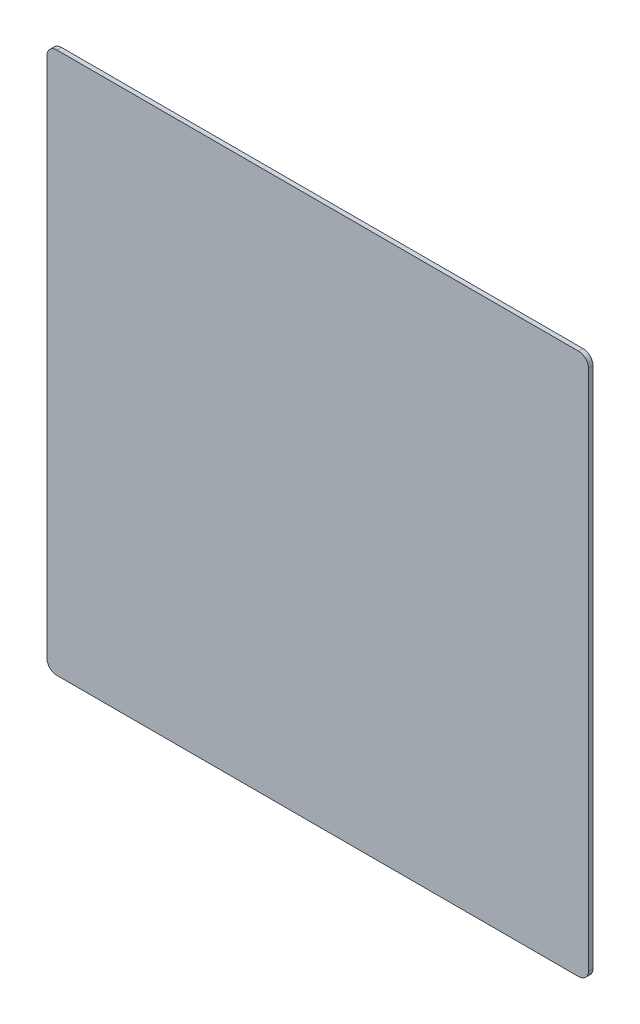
ISO-10303-21;
HEADER;
FILE_DESCRIPTION(('STEP AP214'),'2;1');
FILE_NAME('part.step','',(''),(''),'','','');
FILE_SCHEMA(('AUTOMOTIVE_DESIGN { 1 0 10303 214 1 1 1 1 }'));
ENDSEC;
DATA;
#1=APPLICATION_CONTEXT('core data for automotive mechanical design processes');
#2=APPLICATION_PROTOCOL_DEFINITION('international standard','automotive_design',2000,#1);
#3=PRODUCT_CONTEXT('',#1,'mechanical');
#4=PRODUCT('Part','Part','',(#3));
#5=PRODUCT_RELATED_PRODUCT_CATEGORY('part','',(#4));
#6=PRODUCT_DEFINITION_FORMATION('','',#4);
#7=PRODUCT_DEFINITION_CONTEXT('part definition',#1,'design');
#8=PRODUCT_DEFINITION('design','',#6,#7);
#9=PRODUCT_DEFINITION_SHAPE('','',#8);
#10=(LENGTH_UNIT() NAMED_UNIT(*) SI_UNIT(.MILLI.,.METRE.));
#11=(NAMED_UNIT(*) PLANE_ANGLE_UNIT() SI_UNIT($,.RADIAN.));
#12=(NAMED_UNIT(*) SI_UNIT($,.STERADIAN.) SOLID_ANGLE_UNIT());
#13=UNCERTAINTY_MEASURE_WITH_UNIT(LENGTH_MEASURE(1.E-05),#10,'distance_accuracy_value','');
#14=(GEOMETRIC_REPRESENTATION_CONTEXT(3) GLOBAL_UNCERTAINTY_ASSIGNED_CONTEXT((#13)) GLOBAL_UNIT_ASSIGNED_CONTEXT((#10,
#11,#12)) REPRESENTATION_CONTEXT('',''));
#15=CARTESIAN_POINT('',(0.,0.,0.));
#16=DIRECTION('',(0.,0.,1.));
#17=DIRECTION('',(1.,0.,0.));
#18=AXIS2_PLACEMENT_3D('',#15,#16,#17);
#19=CARTESIAN_POINT('',(289.,289.,5.));
#20=DIRECTION('',(0.,0.,-1.));
#21=DIRECTION('',(-1.,0.,0.));
#22=AXIS2_PLACEMENT_3D('',#19,#20,#21);
#23=CYLINDRICAL_SURFACE('',#22,11.);
#24=CARTESIAN_POINT('',(289.,289.,0.));
#25=DIRECTION('',(0.,0.,1.));
#26=DIRECTION('',(-1.,0.,0.));
#27=AXIS2_PLACEMENT_3D('',#24,#25,#26);
#28=CIRCLE('',#27,11.);
#29=CARTESIAN_POINT('',(300.,289.,0.));
#30=VERTEX_POINT('',#29);
#31=CARTESIAN_POINT('',(289.,300.,0.));
#32=VERTEX_POINT('',#31);
#33=EDGE_CURVE('E131',#30,#32,#28,.T.);
#34=ORIENTED_EDGE('',*,*,#33,.T.);
#35=DIRECTION('',(0.,0.,-1.));
#36=VECTOR('',#35,1.);
#37=CARTESIAN_POINT('',(289.,300.,5.));
#38=LINE('',#37,#36);
#39=CARTESIAN_POINT('',(289.,300.,5.));
#40=VERTEX_POINT('',#39);
#41=EDGE_CURVE('E11',#40,#32,#38,.T.);
#42=ORIENTED_EDGE('',*,*,#41,.F.);
#43=CARTESIAN_POINT('',(289.,289.,5.));
#44=DIRECTION('',(0.,0.,1.));
#45=DIRECTION('',(-1.,0.,0.));
#46=AXIS2_PLACEMENT_3D('',#43,#44,#45);
#47=CIRCLE('',#46,11.);
#48=CARTESIAN_POINT('',(300.,289.,5.));
#49=VERTEX_POINT('',#48);
#50=EDGE_CURVE('E145',#49,#40,#47,.T.);
#51=ORIENTED_EDGE('',*,*,#50,.F.);
#52=DIRECTION('',(0.,0.,-1.));
#53=VECTOR('',#52,1.);
#54=CARTESIAN_POINT('',(300.,289.,5.));
#55=LINE('',#54,#53);
#56=EDGE_CURVE('E127',#49,#30,#55,.T.);
#57=ORIENTED_EDGE('',*,*,#56,.T.);
#58=EDGE_LOOP('',(#34,#42,#51,#57));
#59=FACE_BOUND('',#58,.T.);
#60=ADVANCED_FACE('F35',(#59),#23,.T.);
#61=CARTESIAN_POINT('',(-289.,300.,5.));
#62=DIRECTION('',(0.,-1.,0.));
#63=DIRECTION('',(0.,0.,-1.));
#64=AXIS2_PLACEMENT_3D('',#61,#62,#63);
#65=PLANE('',#64);
#66=DIRECTION('',(-1.,0.,0.));
#67=VECTOR('',#66,1.);
#68=CARTESIAN_POINT('',(-289.,300.,0.));
#69=LINE('',#68,#67);
#70=CARTESIAN_POINT('',(-289.,300.,0.));
#71=VERTEX_POINT('',#70);
#72=EDGE_CURVE('E134',#32,#71,#69,.T.);
#73=ORIENTED_EDGE('',*,*,#72,.T.);
#74=DIRECTION('',(0.,0.,-1.));
#75=VECTOR('',#74,1.);
#76=CARTESIAN_POINT('',(-289.,300.,5.));
#77=LINE('',#76,#75);
#78=CARTESIAN_POINT('',(-289.,300.,5.));
#79=VERTEX_POINT('',#78);
#80=EDGE_CURVE('E43',#79,#71,#77,.T.);
#81=ORIENTED_EDGE('',*,*,#80,.F.);
#82=DIRECTION('',(-1.,0.,0.));
#83=VECTOR('',#82,1.);
#84=CARTESIAN_POINT('',(-289.,300.,5.));
#85=LINE('',#84,#83);
#86=EDGE_CURVE('E94',#40,#79,#85,.T.);
#87=ORIENTED_EDGE('',*,*,#86,.F.);
#88=ORIENTED_EDGE('',*,*,#41,.T.);
#89=EDGE_LOOP('',(#73,#81,#87,#88));
#90=FACE_BOUND('',#89,.T.);
#91=ADVANCED_FACE('F180',(#90),#65,.F.);
#92=CARTESIAN_POINT('',(-289.,289.,5.));
#93=DIRECTION('',(0.,0.,-1.));
#94=DIRECTION('',(-1.,0.,0.));
#95=AXIS2_PLACEMENT_3D('',#92,#93,#94);
#96=CYLINDRICAL_SURFACE('',#95,11.);
#97=CARTESIAN_POINT('',(-289.,289.,0.));
#98=DIRECTION('',(0.,0.,1.));
#99=DIRECTION('',(-1.,0.,0.));
#100=AXIS2_PLACEMENT_3D('',#97,#98,#99);
#101=CIRCLE('',#100,11.);
#102=CARTESIAN_POINT('',(-300.,289.,0.));
#103=VERTEX_POINT('',#102);
#104=EDGE_CURVE('E136',#71,#103,#101,.T.);
#105=ORIENTED_EDGE('',*,*,#104,.T.);
#106=DIRECTION('',(0.,0.,-1.));
#107=VECTOR('',#106,1.);
#108=CARTESIAN_POINT('',(-300.,289.,5.));
#109=LINE('',#108,#107);
#110=CARTESIAN_POINT('',(-300.,289.,5.));
#111=VERTEX_POINT('',#110);
#112=EDGE_CURVE('E152',#111,#103,#109,.T.);
#113=ORIENTED_EDGE('',*,*,#112,.F.);
#114=CARTESIAN_POINT('',(-289.,289.,5.));
#115=DIRECTION('',(0.,0.,1.));
#116=DIRECTION('',(-1.,0.,0.));
#117=AXIS2_PLACEMENT_3D('',#114,#115,#116);
#118=CIRCLE('',#117,11.);
#119=EDGE_CURVE('E160',#79,#111,#118,.T.);
#120=ORIENTED_EDGE('',*,*,#119,.F.);
#121=ORIENTED_EDGE('',*,*,#80,.T.);
#122=EDGE_LOOP('',(#105,#113,#120,#121));
#123=FACE_BOUND('',#122,.T.);
#124=ADVANCED_FACE('F158',(#123),#96,.T.);
#125=CARTESIAN_POINT('',(-300.,-289.,5.));
#126=DIRECTION('',(1.,0.,0.));
#127=DIRECTION('',(0.,0.,-1.));
#128=AXIS2_PLACEMENT_3D('',#125,#126,#127);
#129=PLANE('',#128);
#130=DIRECTION('',(0.,-1.,0.));
#131=VECTOR('',#130,1.);
#132=CARTESIAN_POINT('',(-300.,-289.,0.));
#133=LINE('',#132,#131);
#134=CARTESIAN_POINT('',(-300.,-289.,0.));
#135=VERTEX_POINT('',#134);
#136=EDGE_CURVE('E138',#103,#135,#133,.T.);
#137=ORIENTED_EDGE('',*,*,#136,.T.);
#138=DIRECTION('',(0.,0.,-1.));
#139=VECTOR('',#138,1.);
#140=CARTESIAN_POINT('',(-300.,-289.,5.));
#141=LINE('',#140,#139);
#142=CARTESIAN_POINT('',(-300.,-289.,5.));
#143=VERTEX_POINT('',#142);
#144=EDGE_CURVE('E149',#143,#135,#141,.T.);
#145=ORIENTED_EDGE('',*,*,#144,.F.);
#146=DIRECTION('',(0.,-1.,0.));
#147=VECTOR('',#146,1.);
#148=CARTESIAN_POINT('',(-300.,-289.,5.));
#149=LINE('',#148,#147);
#150=EDGE_CURVE('E172',#111,#143,#149,.T.);
#151=ORIENTED_EDGE('',*,*,#150,.F.);
#152=ORIENTED_EDGE('',*,*,#112,.T.);
#153=EDGE_LOOP('',(#137,#145,#151,#152));
#154=FACE_BOUND('',#153,.T.);
#155=ADVANCED_FACE('F168',(#154),#129,.F.);
#156=CARTESIAN_POINT('',(-289.,-289.,5.));
#157=DIRECTION('',(0.,0.,-1.));
#158=DIRECTION('',(-1.,0.,0.));
#159=AXIS2_PLACEMENT_3D('',#156,#157,#158);
#160=CYLINDRICAL_SURFACE('',#159,11.);
#161=CARTESIAN_POINT('',(-289.,-289.,0.));
#162=DIRECTION('',(0.,0.,1.));
#163=DIRECTION('',(-1.,0.,0.));
#164=AXIS2_PLACEMENT_3D('',#161,#162,#163);
#165=CIRCLE('',#164,11.);
#166=CARTESIAN_POINT('',(-289.,-300.,0.));
#167=VERTEX_POINT('',#166);
#168=EDGE_CURVE('E140',#135,#167,#165,.T.);
#169=ORIENTED_EDGE('',*,*,#168,.T.);
#170=DIRECTION('',(0.,0.,-1.));
#171=VECTOR('',#170,1.);
#172=CARTESIAN_POINT('',(-289.,-300.,5.));
#173=LINE('',#172,#171);
#174=CARTESIAN_POINT('',(-289.,-300.,5.));
#175=VERTEX_POINT('',#174);
#176=EDGE_CURVE('E122',#175,#167,#173,.T.);
#177=ORIENTED_EDGE('',*,*,#176,.F.);
#178=CARTESIAN_POINT('',(-289.,-289.,5.));
#179=DIRECTION('',(0.,0.,1.));
#180=DIRECTION('',(-1.,0.,0.));
#181=AXIS2_PLACEMENT_3D('',#178,#179,#180);
#182=CIRCLE('',#181,11.);
#183=EDGE_CURVE('E113',#143,#175,#182,.T.);
#184=ORIENTED_EDGE('',*,*,#183,.F.);
#185=ORIENTED_EDGE('',*,*,#144,.T.);
#186=EDGE_LOOP('',(#169,#177,#184,#185));
#187=FACE_BOUND('',#186,.T.);
#188=ADVANCED_FACE('F171',(#187),#160,.T.);
#189=CARTESIAN_POINT('',(-289.,-300.,5.));
#190=DIRECTION('',(0.,1.,0.));
#191=DIRECTION('',(0.,0.,1.));
#192=AXIS2_PLACEMENT_3D('',#189,#190,#191);
#193=PLANE('',#192);
#194=DIRECTION('',(1.,0.,0.));
#195=VECTOR('',#194,1.);
#196=CARTESIAN_POINT('',(-289.,-300.,0.));
#197=LINE('',#196,#195);
#198=CARTESIAN_POINT('',(289.,-300.,0.));
#199=VERTEX_POINT('',#198);
#200=EDGE_CURVE('E121',#167,#199,#197,.T.);
#201=ORIENTED_EDGE('',*,*,#200,.T.);
#202=DIRECTION('',(0.,0.,-1.));
#203=VECTOR('',#202,1.);
#204=CARTESIAN_POINT('',(289.,-300.,5.));
#205=LINE('',#204,#203);
#206=CARTESIAN_POINT('',(289.,-300.,5.));
#207=VERTEX_POINT('',#206);
#208=EDGE_CURVE('E118',#207,#199,#205,.T.);
#209=ORIENTED_EDGE('',*,*,#208,.F.);
#210=DIRECTION('',(1.,0.,0.));
#211=VECTOR('',#210,1.);
#212=CARTESIAN_POINT('',(-289.,-300.,5.));
#213=LINE('',#212,#211);
#214=EDGE_CURVE('E107',#175,#207,#213,.T.);
#215=ORIENTED_EDGE('',*,*,#214,.F.);
#216=ORIENTED_EDGE('',*,*,#176,.T.);
#217=EDGE_LOOP('',(#201,#209,#215,#216));
#218=FACE_BOUND('',#217,.T.);
#219=ADVANCED_FACE('F119',(#218),#193,.F.);
#220=CARTESIAN_POINT('',(289.,-289.,5.));
#221=DIRECTION('',(0.,0.,-1.));
#222=DIRECTION('',(-1.,0.,0.));
#223=AXIS2_PLACEMENT_3D('',#220,#221,#222);
#224=CYLINDRICAL_SURFACE('',#223,11.);
#225=CARTESIAN_POINT('',(289.,-289.,0.));
#226=DIRECTION('',(0.,0.,1.));
#227=DIRECTION('',(1.,0.,0.));
#228=AXIS2_PLACEMENT_3D('',#225,#226,#227);
#229=CIRCLE('',#228,11.);
#230=CARTESIAN_POINT('',(300.,-289.,0.));
#231=VERTEX_POINT('',#230);
#232=EDGE_CURVE('E80',#199,#231,#229,.T.);
#233=ORIENTED_EDGE('',*,*,#232,.T.);
#234=DIRECTION('',(0.,0.,-1.));
#235=VECTOR('',#234,1.);
#236=CARTESIAN_POINT('',(300.,-289.,5.));
#237=LINE('',#236,#235);
#238=CARTESIAN_POINT('',(300.,-289.,5.));
#239=VERTEX_POINT('',#238);
#240=EDGE_CURVE('E123',#239,#231,#237,.T.);
#241=ORIENTED_EDGE('',*,*,#240,.F.);
#242=CARTESIAN_POINT('',(289.,-289.,5.));
#243=DIRECTION('',(0.,0.,1.));
#244=DIRECTION('',(1.,0.,0.));
#245=AXIS2_PLACEMENT_3D('',#242,#243,#244);
#246=CIRCLE('',#245,11.);
#247=EDGE_CURVE('E111',#207,#239,#246,.T.);
#248=ORIENTED_EDGE('',*,*,#247,.F.);
#249=ORIENTED_EDGE('',*,*,#208,.T.);
#250=EDGE_LOOP('',(#233,#241,#248,#249));
#251=FACE_BOUND('',#250,.T.);
#252=ADVANCED_FACE('F125',(#251),#224,.T.);
#253=CARTESIAN_POINT('',(300.,-289.,5.));
#254=DIRECTION('',(-1.,0.,0.));
#255=DIRECTION('',(0.,0.,1.));
#256=AXIS2_PLACEMENT_3D('',#253,#254,#255);
#257=PLANE('',#256);
#258=DIRECTION('',(0.,1.,0.));
#259=VECTOR('',#258,1.);
#260=CARTESIAN_POINT('',(300.,-289.,0.));
#261=LINE('',#260,#259);
#262=EDGE_CURVE('E86',#231,#30,#261,.T.);
#263=ORIENTED_EDGE('',*,*,#262,.T.);
#264=ORIENTED_EDGE('',*,*,#56,.F.);
#265=DIRECTION('',(0.,1.,0.));
#266=VECTOR('',#265,1.);
#267=CARTESIAN_POINT('',(300.,-289.,5.));
#268=LINE('',#267,#266);
#269=EDGE_CURVE('E51',#239,#49,#268,.T.);
#270=ORIENTED_EDGE('',*,*,#269,.F.);
#271=ORIENTED_EDGE('',*,*,#240,.T.);
#272=EDGE_LOOP('',(#263,#264,#270,#271));
#273=FACE_BOUND('',#272,.T.);
#274=ADVANCED_FACE('F196',(#273),#257,.F.);
#275=CARTESIAN_POINT('',(289.,289.,5.));
#276=DIRECTION('',(0.,0.,-1.));
#277=DIRECTION('',(-1.,0.,0.));
#278=AXIS2_PLACEMENT_3D('',#275,#276,#277);
#279=PLANE('',#278);
#280=ORIENTED_EDGE('',*,*,#50,.T.);
#281=ORIENTED_EDGE('',*,*,#86,.T.);
#282=ORIENTED_EDGE('',*,*,#119,.T.);
#283=ORIENTED_EDGE('',*,*,#150,.T.);
#284=ORIENTED_EDGE('',*,*,#183,.T.);
#285=ORIENTED_EDGE('',*,*,#214,.T.);
#286=ORIENTED_EDGE('',*,*,#247,.T.);
#287=ORIENTED_EDGE('',*,*,#269,.T.);
#288=EDGE_LOOP('',(#280,#281,#282,#283,#284,#285,#286,#287));
#289=FACE_BOUND('',#288,.T.);
#290=ADVANCED_FACE('F109',(#289),#279,.F.);
#291=CARTESIAN_POINT('',(289.,289.,0.));
#292=DIRECTION('',(0.,0.,-1.));
#293=DIRECTION('',(-1.,0.,0.));
#294=AXIS2_PLACEMENT_3D('',#291,#292,#293);
#295=PLANE('',#294);
#296=ORIENTED_EDGE('',*,*,#33,.F.);
#297=ORIENTED_EDGE('',*,*,#262,.F.);
#298=ORIENTED_EDGE('',*,*,#232,.F.);
#299=ORIENTED_EDGE('',*,*,#200,.F.);
#300=ORIENTED_EDGE('',*,*,#168,.F.);
#301=ORIENTED_EDGE('',*,*,#136,.F.);
#302=ORIENTED_EDGE('',*,*,#104,.F.);
#303=ORIENTED_EDGE('',*,*,#72,.F.);
#304=EDGE_LOOP('',(#296,#297,#298,#299,#300,#301,#302,#303));
#305=FACE_BOUND('',#304,.T.);
#306=ADVANCED_FACE('F164',(#305),#295,.T.);
#307=CLOSED_SHELL('',(#60,#91,#124,#155,#188,#219,#252,#274,#290,#306));
#308=MANIFOLD_SOLID_BREP('B2',#307);
#309=ADVANCED_BREP_SHAPE_REPRESENTATION('',(#18,#308),#14);
#310=SHAPE_DEFINITION_REPRESENTATION(#9,#309);
ENDSEC;
END-ISO-10303-21;
